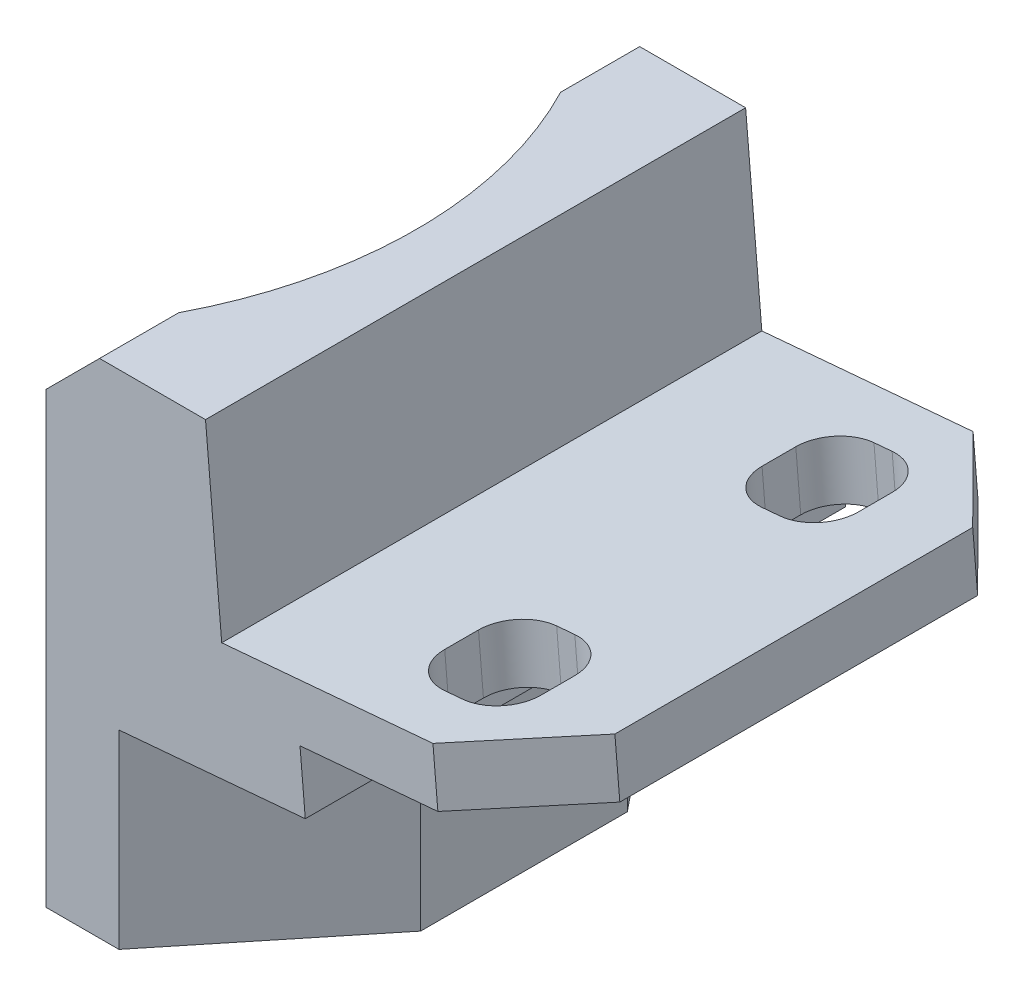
from build123d import *

# Parameters (mm, degrees)
EXTRUDE1_DEPTH              = 10.16
EXTRUDE1_DEPTH_BACK         = 10.16
EXTRUDE2_DEPTH              = 19.475775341
CHAMFER2_SIZE               = 5.08
CHAMFER2_SIZE2              = 6.273277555
CHAMFER3_SIZE               = 5.08
CHAMFER3_SIZE2              = 6.273277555
F_32_0_116_DIAMETER_HOLE1_D = 2.9464
CUT_EXTRUDE1_DEPTH          = 38.7206145
CUT_EXTRUDE1_DEPTH_BACK     = 38.7206145
SKETCH8_W                   = 1.245655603
SKETCH8_H                   = 20.32
CUT_EXTRUDE3_DEPTH          = 34.427980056
CHAMFER4_SIZE               = 3.429
SKETCH9_W                   = 8.347725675
SKETCH9_H                   = 20.32
CUT_EXTRUDE4_DEPTH          = 0.5842
CUT_EXTRUDE5_DEPTH          = 34.811609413
SKETCH11_W                  = 8.636
SKETCH11_H                  = 20.32
CUT_EXTRUDE6_DEPTH          = 2.286
SKETCH12_R                  = 15.5702
CUT_EXTRUDE7_DEPTH          = 38.259242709


with BuildPart() as part:
    # Sketch1 → Extrude1 (new, two sides: drawn at the far end of the back side and taken through both)
    with BuildSketch(Plane.XY.offset(-EXTRUDE1_DEPTH_BACK)):
        Polygon((15.5575, 0), (15.5575, -19.475775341), (20.1295, -19.475775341), (20.1295, -11.296975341), (30.664528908, -10.375279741), (30.279335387, -5.972497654), (20.157997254, -6.858), (19.558, 0), align=None)
    extrude(amount=EXTRUDE1_DEPTH + EXTRUDE1_DEPTH_BACK)

    # Sketch2 → Extrude2 (add)
    with BuildSketch(Plane(origin=(0, 0, 0), x_dir=(1, 0, 0), z_dir=(0, 1, 0))):
        with BuildLine():
            Line((11.781774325, 10.16), (16.601653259, 10.16))
            Line((16.601653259, 10.16), (16.601653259, -10.16))
            Line((16.601653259, -10.16), (11.781774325, -10.16))
            ThreePointArc((11.781774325, -10.16), (15.5575, 0), (11.781774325, 10.16))
        make_face()
    extrude(amount=-EXTRUDE2_DEPTH)

    # Chamfer2
    chamfer2_edges = [part.edges().sort_by_distance(p)[0] for p in [
        (20.1295, -15.386375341, -10.16),
    ]]
    chamfer2_side = [part.faces().sort_by_distance(p)[0] for p in [
        (17.995328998, -9.562303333, -10.16),
    ]]
    chamfer(chamfer2_edges, length=CHAMFER2_SIZE, length2=CHAMFER2_SIZE2, reference=chamfer2_side[0])

    # Chamfer3
    chamfer3_edges = [part.edges().sort_by_distance(p)[0] for p in [
        (20.1295, -15.386375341, 10.16),
    ]]
    chamfer3_side = [part.faces().sort_by_distance(p)[0] for p in [
        (17.995328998, -9.562303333, 10.16),
    ]]
    chamfer(chamfer3_edges, length=CHAMFER3_SIZE, length2=CHAMFER3_SIZE2, reference=chamfer3_side[0])

    # 32 _0.116_ Diameter Hole1 (through all)
    with Locations(Plane(origin=(1.133755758, -12.958887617, 0), x_dir=(0.9961946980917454, 0.08715574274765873, 0), z_dir=(0.08715574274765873, -0.9961946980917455, 0))):
        with Locations((24.563575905, 5.969)):
            f_32_0_116_diameter_hole1 = Hole(F_32_0_116_DIAMETER_HOLE1_D / 2)

    # Mirror1: 32 _0.116_ Diameter Hole1 across plane
    add(f_32_0_116_diameter_hole1.mirror(Plane.XY), mode=Mode.SUBTRACT)

    # Sketch5 → Cut-Extrude1 (cut, two sides: drawn at the far end of the back side and taken through both)
    with BuildSketch(Plane.XY.offset(-CUT_EXTRUDE1_DEPTH_BACK)):
        Polygon((11.781774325, 0), (14.321774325, 0), (11.781774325, -2.54), align=None)
    extrude(amount=CUT_EXTRUDE1_DEPTH + CUT_EXTRUDE1_DEPTH_BACK, mode=Mode.SUBTRACT)

    # Sketch8 → Cut-Extrude3 (cut, through all)
    with BuildSketch(Plane(origin=(0.748562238, -8.556105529, 0), x_dir=(-0.9961946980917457, -0.08715574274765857, 0), z_dir=(-0.08715574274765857, 0.9961946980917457, 0))):
        with Locations((-18.860748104, 0)):
            Rectangle(SKETCH8_W, SKETCH8_H)
    extrude(amount=CUT_EXTRUDE3_DEPTH, mode=Mode.SUBTRACT)

    # Chamfer4
    chamfer4_edges = [part.edges().sort_by_distance(p)[0] for p in [
        (30.471932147, -8.173888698, 10.16),
        (30.471932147, -8.173888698, -10.16),
    ]]
    chamfer(chamfer4_edges, length=CHAMFER4_SIZE)

    # Sketch9 → Cut-Extrude4 (cut)
    with BuildSketch(Plane.XZ.offset(19.475775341)):
        with Locations((15.955637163, 0)):
            Rectangle(SKETCH9_W, SKETCH9_H)
    extrude(amount=-CUT_EXTRUDE4_DEPTH, mode=Mode.SUBTRACT)

    # Sketch10 → Cut-Extrude5 (cut, through all)
    with BuildSketch(Plane(origin=(1.133755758, -12.958887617, 0), x_dir=(0.9961946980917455, 0.08715574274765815, 0), z_dir=(0.08715574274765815, -0.9961946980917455, 0))):
        with BuildLine():
            Line((23.090375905, 6.604), (23.090375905, 5.334))
            ThreePointArc((23.090375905, 5.334), (23.521866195, 4.29229029), (24.563575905, 3.8608))
            Line((24.563575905, 3.8608), (25.249375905, 3.8608))
            ThreePointArc((25.249375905, 3.8608), (26.291085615, 4.29229029), (26.722575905, 5.334))
            Line((26.722575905, 5.334), (26.722575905, 6.604))
            ThreePointArc((26.722575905, 6.604), (26.291085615, 7.64570971), (25.249375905, 8.0772))
            Line((25.249375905, 8.0772), (24.563575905, 8.0772))
            ThreePointArc((24.563575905, 8.0772), (23.521866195, 7.64570971), (23.090375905, 6.604))
        make_face()
    cut_extrude5 = extrude(amount=-CUT_EXTRUDE5_DEPTH, mode=Mode.SUBTRACT)

    # Mirror2: Cut-Extrude5 across plane
    add(cut_extrude5.mirror(Plane.XY), mode=Mode.SUBTRACT)

    # Sketch11 → Cut-Extrude6 (cut)
    with BuildSketch(Plane(origin=(1.133755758, -12.958887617, 0), x_dir=(0.9961946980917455, 0.08715574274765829, 0), z_dir=(0.08715574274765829, -0.9961946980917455, 0))):
        with Locations((25.325575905, 0)):
            Rectangle(SKETCH11_W, SKETCH11_H)
    extrude(amount=-CUT_EXTRUDE6_DEPTH, mode=Mode.SUBTRACT)

    # Sketch12 → Cut-Extrude7 (cut, through all)
    with BuildSketch(Plane.XZ.offset(18.891575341)):
        with Locations((0.508, 0)):
            Circle(SKETCH12_R)
    extrude(amount=-CUT_EXTRUDE7_DEPTH, mode=Mode.SUBTRACT)


solid = part.part
